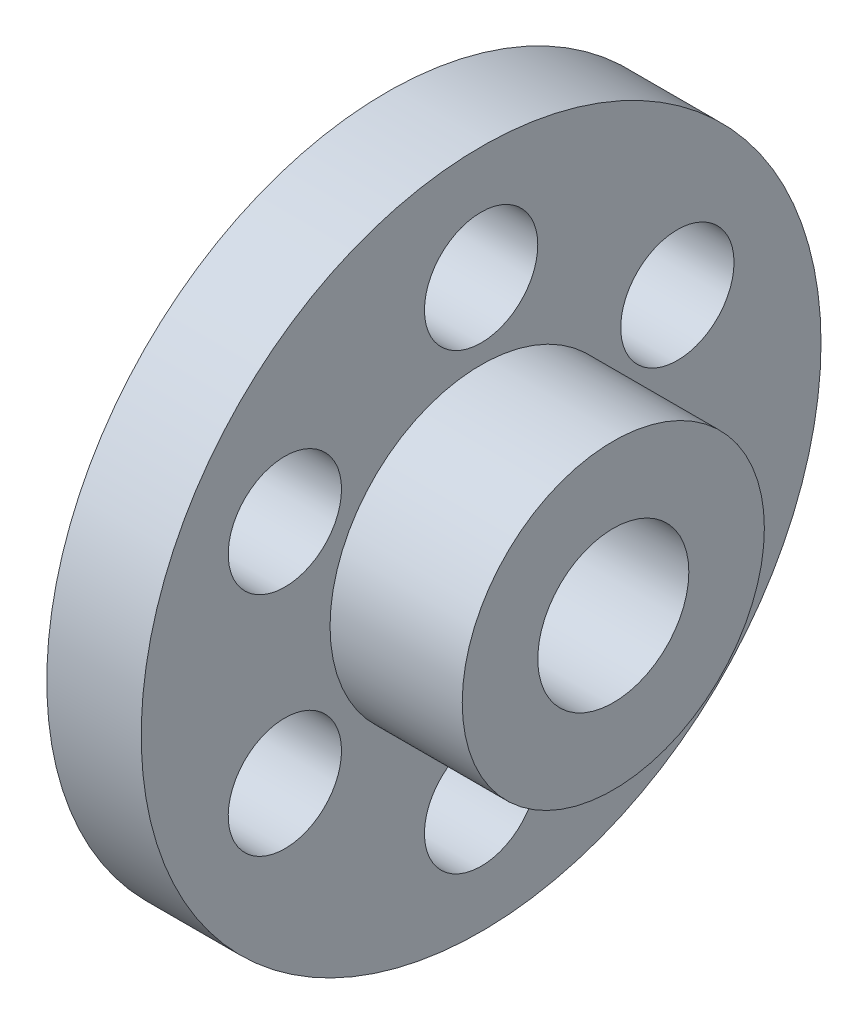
from build123d import *

# Parameters (mm, degrees)
SZKIC_OTWORU_RODKOWEGO_R = 20
OTW_R_RODKOWY_DEPTH      = 141.712472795
SZKIC_OTWORU_MOCOWANIA_R = 15
OTW_R_MOCOWANIA_DEPTH    = 141.712472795
POWIELENIE_OTWOR_W_COUNT = 6


with BuildPart() as part:
    # Szkic bazowy → Obr_t bazowy (revolve)
    with BuildSketch(Plane.XY, mode=Mode.PRIVATE) as obr_t_bazowy_sk:
        Polygon((0, 0), (0, 90), (25, 90), (25, 40), (60, 40), (60, 0), align=None)
    revolve(obr_t_bazowy_sk.sketch.rotate(Axis((0, 0, 0), (-1, 0, 0)), 90), axis=Axis((0, 0, 0), (-1, 0, 0)))

    # Szkic otworu _rodkowego → Otw_r _rodkowy (cut, through all)
    with BuildSketch(Plane(origin=(60, 0, 0), x_dir=(0, 0, -1), z_dir=(1, 0, 0))):
        Circle(SZKIC_OTWORU_RODKOWEGO_R)
    extrude(amount=-OTW_R_RODKOWY_DEPTH, mode=Mode.SUBTRACT)

    # Szkic otworu mocowania → Otw_r mocowania (cut, through all)
    with BuildSketch(Plane.ZY):
        with Locations((0, 60)):
            Circle(SZKIC_OTWORU_MOCOWANIA_R)
    otw_r_mocowania = extrude(amount=-OTW_R_MOCOWANIA_DEPTH, mode=Mode.SUBTRACT)

    # Powielenie otwor_w: Otw_r mocowania ×6 about axis
    powielenie_otwor_w_axis = Axis((0, 0, 0), (1, 0, 0))
    for i in range(1, POWIELENIE_OTWOR_W_COUNT):
        add(otw_r_mocowania.rotate(powielenie_otwor_w_axis, i * 360 / POWIELENIE_OTWOR_W_COUNT), mode=Mode.SUBTRACT)


solid = part.part
